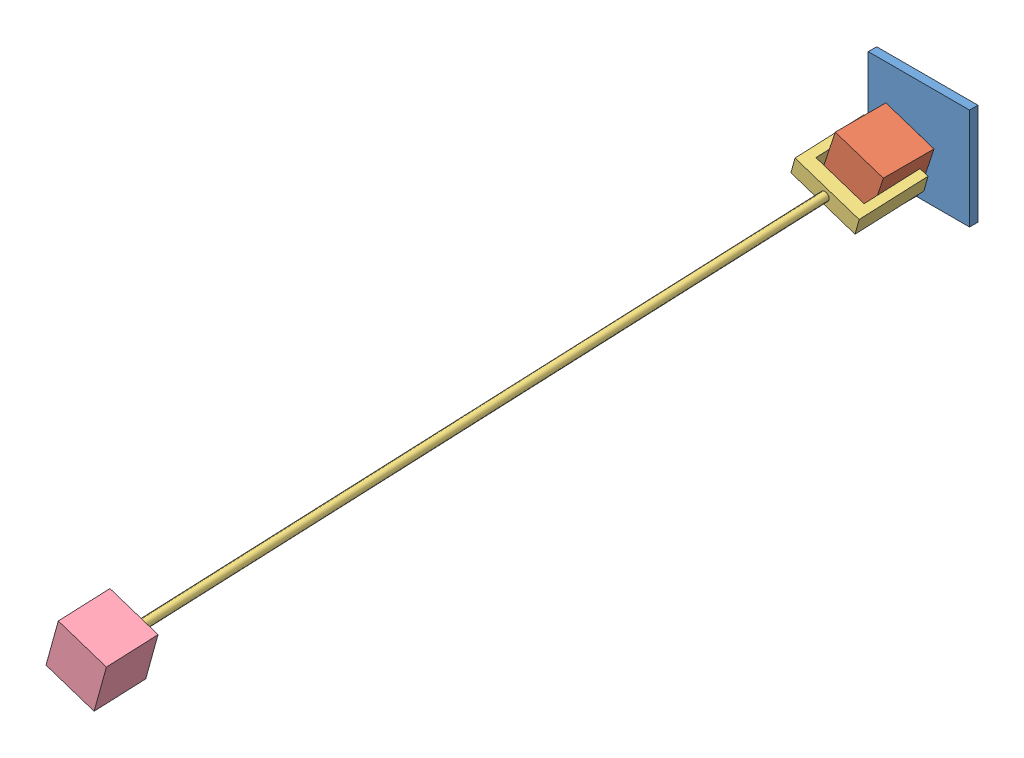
SolidWorks assembly M05 Stick Assem - Z_Up.SLDASM, configuration Default (file format 12000). Lengths in mm.
Overall size (324.44 413.04 2514.16).
5 component instances, 4 part files, 4 mates.
Components (placement in the parent):
- base-3: base.SLDPRT [Default] x (1 0 0) z (0 -1 0) size (304.8 127 304.8)
- shoulder_joint-1: shoulder_joint.SLDPRT [Default] at (0 0 139.7) x (0.94953 -0.313675 0) z (-0.313675 -0.94953 0) size (152.4 152.4 152.4)
- yoke_mass assembly_z_up-1: yoke_mass assembly_z_up.SLDASM [Default] at (0 0 139.7) x (0.94953 -0.313675 0) z (-0.31291 -0.947214 -0.069813) size (203.2 2413 152.4)
  - yoke-1: yoke.SLDPRT [Default] x (0 -1 0) z (1 0 0) size (2336.8 50.8 203.2)
  - mass_block-1: mass_block.SLDPRT [Default] at (0 2286 0) x (0 -1 0) z (0 0 1) size (152.4 152.4 152.4)
Mates (geometry in assembly coordinates):
- Concentric1: concentric aligned: cylinder of base-3 through (0 0 114.3) axis (0 0 -1) radius 12.7; cylinder of shoulder_joint-1 through (0 0 114.3) axis (0 0 -1) radius 12.7
- Coincident10: coincident anti-aligned: plane of base-3 through (0 0 114.3) normal (0 0 1); plane of shoulder_joint-1 through (0 0 114.3) normal (0 0 -1)
- Concentric4: concentric anti-aligned: cylinder of shoulder_joint-1 through (72.3542 -23.902 139.7) axis (-0.94953 0.313675 0) radius 12.7; cylinder of Yoke Mass Assembly-1/yoke-1 through (-106.4623 35.1696 139.7) axis (0.94953 -0.313675 0) radius 12.7
- Coincident12: coincident anti-aligned: plane of shoulder_joint-1 through (-48.4522 96.2562 215.9) normal (-0.94953 0.313675 0); plane of Yoke Mass Assembly-1/yoke-1 through (-66.9093 40.3843 255.4944) normal (0.94953 -0.313675 0)
